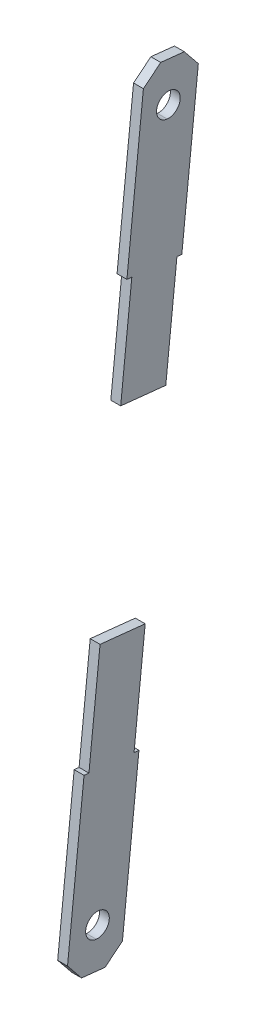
ISO-10303-21;
HEADER;
FILE_DESCRIPTION(('STEP AP214'),'2;1');
FILE_NAME('part.step','',(''),(''),'','','');
FILE_SCHEMA(('AUTOMOTIVE_DESIGN { 1 0 10303 214 1 1 1 1 }'));
ENDSEC;
DATA;
#1=APPLICATION_CONTEXT('core data for automotive mechanical design processes');
#2=APPLICATION_PROTOCOL_DEFINITION('international standard','automotive_design',2000,#1);
#3=PRODUCT_CONTEXT('',#1,'mechanical');
#4=PRODUCT('Part','Part','',(#3));
#5=PRODUCT_RELATED_PRODUCT_CATEGORY('part','',(#4));
#6=PRODUCT_DEFINITION_FORMATION('','',#4);
#7=PRODUCT_DEFINITION_CONTEXT('part definition',#1,'design');
#8=PRODUCT_DEFINITION('design','',#6,#7);
#9=PRODUCT_DEFINITION_SHAPE('','',#8);
#10=(LENGTH_UNIT() NAMED_UNIT(*) SI_UNIT(.MILLI.,.METRE.));
#11=(NAMED_UNIT(*) PLANE_ANGLE_UNIT() SI_UNIT($,.RADIAN.));
#12=(NAMED_UNIT(*) SI_UNIT($,.STERADIAN.) SOLID_ANGLE_UNIT());
#13=UNCERTAINTY_MEASURE_WITH_UNIT(LENGTH_MEASURE(1.E-05),#10,'distance_accuracy_value','');
#14=(GEOMETRIC_REPRESENTATION_CONTEXT(3) GLOBAL_UNCERTAINTY_ASSIGNED_CONTEXT((#13)) GLOBAL_UNIT_ASSIGNED_CONTEXT((#10,
#11,#12)) REPRESENTATION_CONTEXT('',''));
#15=CARTESIAN_POINT('',(0.,0.,0.));
#16=DIRECTION('',(0.,0.,1.));
#17=DIRECTION('',(1.,0.,0.));
#18=AXIS2_PLACEMENT_3D('',#15,#16,#17);
#19=CARTESIAN_POINT('',(73.25,-17.1057766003,1.7978895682));
#20=DIRECTION('',(-1.,0.,0.));
#21=DIRECTION('',(0.,-0.994521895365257,0.104528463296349));
#22=AXIS2_PLACEMENT_3D('',#19,#20,#21);
#23=CYLINDRICAL_SURFACE('',#22,0.6);
#24=DIRECTION('',(1.,0.,0.));
#25=VECTOR('',#24,1.);
#26=CARTESIAN_POINT('',(73.25,-17.7024897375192,1.86060664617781));
#27=LINE('',#26,#25);
#28=CARTESIAN_POINT('',(73.,-17.7024897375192,1.86060664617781));
#29=VERTEX_POINT('',#28);
#30=CARTESIAN_POINT('',(73.5,-17.7024897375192,1.86060664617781));
#31=VERTEX_POINT('',#30);
#32=EDGE_CURVE('P0_E11',#29,#31,#27,.T.);
#33=ORIENTED_EDGE('',*,*,#32,.F.);
#34=CARTESIAN_POINT('',(73.,-17.1057766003,1.7978895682));
#35=DIRECTION('',(1.,0.,0.));
#36=DIRECTION('',(0.,-0.994521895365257,0.104528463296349));
#37=AXIS2_PLACEMENT_3D('',#34,#35,#36);
#38=CIRCLE('',#37,0.6);
#39=CARTESIAN_POINT('',(73.,-16.5090634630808,1.73517249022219));
#40=VERTEX_POINT('',#39);
#41=EDGE_CURVE('P0_E40',#40,#29,#38,.T.);
#42=ORIENTED_EDGE('',*,*,#41,.F.);
#43=DIRECTION('',(-1.,0.,0.));
#44=VECTOR('',#43,1.);
#45=CARTESIAN_POINT('',(73.25,-16.5090634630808,1.73517249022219));
#46=LINE('',#45,#44);
#47=CARTESIAN_POINT('',(73.5,-16.5090634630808,1.73517249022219));
#48=VERTEX_POINT('',#47);
#49=EDGE_CURVE('P0_E27',#48,#40,#46,.T.);
#50=ORIENTED_EDGE('',*,*,#49,.F.);
#51=CARTESIAN_POINT('',(73.5,-17.1057766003,1.7978895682));
#52=DIRECTION('',(-1.,0.,0.));
#53=DIRECTION('',(0.,-0.994521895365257,0.104528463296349));
#54=AXIS2_PLACEMENT_3D('',#51,#52,#53);
#55=CIRCLE('',#54,0.6);
#56=EDGE_CURVE('P0_E178',#31,#48,#55,.T.);
#57=ORIENTED_EDGE('',*,*,#56,.F.);
#58=EDGE_LOOP('',(#33,#42,#50,#57));
#59=FACE_BOUND('',#58,.T.);
#60=ADVANCED_FACE('P0_F16',(#59),#23,.F.);
#61=CARTESIAN_POINT('',(73.25,-17.1057766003,1.7978895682));
#62=DIRECTION('',(-1.,0.,0.));
#63=DIRECTION('',(0.,-0.994521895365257,0.104528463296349));
#64=AXIS2_PLACEMENT_3D('',#61,#62,#63);
#65=CYLINDRICAL_SURFACE('',#64,0.6);
#66=ORIENTED_EDGE('',*,*,#32,.T.);
#67=CARTESIAN_POINT('',(73.5,-17.1057766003,1.7978895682));
#68=DIRECTION('',(-1.,0.,0.));
#69=DIRECTION('',(0.,-0.994521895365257,0.104528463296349));
#70=AXIS2_PLACEMENT_3D('',#67,#68,#69);
#71=CIRCLE('',#70,0.6);
#72=EDGE_CURVE('P0_E181',#48,#31,#71,.T.);
#73=ORIENTED_EDGE('',*,*,#72,.F.);
#74=ORIENTED_EDGE('',*,*,#49,.T.);
#75=CARTESIAN_POINT('',(73.,-17.1057766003,1.7978895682));
#76=DIRECTION('',(1.,0.,0.));
#77=DIRECTION('',(0.,-0.994521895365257,0.104528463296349));
#78=AXIS2_PLACEMENT_3D('',#75,#76,#77);
#79=CIRCLE('',#78,0.6);
#80=EDGE_CURVE('P0_E192',#29,#40,#79,.T.);
#81=ORIENTED_EDGE('',*,*,#80,.F.);
#82=EDGE_LOOP('',(#66,#73,#74,#81));
#83=FACE_BOUND('',#82,.T.);
#84=ADVANCED_FACE('P0_F308',(#83),#65,.F.);
#85=CARTESIAN_POINT('',(73.5,-7.53761086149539,1.94856934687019));
#86=DIRECTION('',(0.,0.104528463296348,0.994521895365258));
#87=DIRECTION('',(1.,0.,0.));
#88=AXIS2_PLACEMENT_3D('',#85,#86,#87);
#89=PLANE('',#88);
#90=DIRECTION('',(0.,-0.994521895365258,0.104528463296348));
#91=VECTOR('',#90,1.);
#92=CARTESIAN_POINT('',(73.,-4.8524017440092,1.66634249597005));
#93=LINE('',#92,#91);
#94=CARTESIAN_POINT('',(73.,-4.8524017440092,1.66634249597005));
#95=VERTEX_POINT('',#94);
#96=CARTESIAN_POINT('',(73.,-10.2228199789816,2.23079619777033));
#97=VERTEX_POINT('',#96);
#98=EDGE_CURVE('P0_E155',#95,#97,#93,.T.);
#99=ORIENTED_EDGE('',*,*,#98,.T.);
#100=DIRECTION('',(-1.,0.,0.));
#101=VECTOR('',#100,1.);
#102=CARTESIAN_POINT('',(73.5,-10.2228199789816,2.23079619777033));
#103=LINE('',#102,#101);
#104=CARTESIAN_POINT('',(73.5,-10.2228199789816,2.23079619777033));
#105=VERTEX_POINT('',#104);
#106=EDGE_CURVE('P0_E210',#105,#97,#103,.T.);
#107=ORIENTED_EDGE('',*,*,#106,.F.);
#108=DIRECTION('',(0.,-0.994521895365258,0.104528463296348));
#109=VECTOR('',#108,1.);
#110=CARTESIAN_POINT('',(73.5,-4.8524017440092,1.66634249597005));
#111=LINE('',#110,#109);
#112=CARTESIAN_POINT('',(73.5,-4.8524017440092,1.66634249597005));
#113=VERTEX_POINT('',#112);
#114=EDGE_CURVE('P0_E177',#113,#105,#111,.T.);
#115=ORIENTED_EDGE('',*,*,#114,.F.);
#116=DIRECTION('',(-1.,0.,0.));
#117=VECTOR('',#116,1.);
#118=CARTESIAN_POINT('',(73.5,-4.8524017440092,1.66634249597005));
#119=LINE('',#118,#117);
#120=EDGE_CURVE('P0_E159',#113,#95,#119,.T.);
#121=ORIENTED_EDGE('',*,*,#120,.T.);
#122=EDGE_LOOP('',(#99,#107,#115,#121));
#123=FACE_BOUND('',#122,.T.);
#124=ADVANCED_FACE('P0_F315',(#123),#89,.T.);
#125=CARTESIAN_POINT('',(73.5,-10.2097539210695,2.35511143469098));
#126=DIRECTION('',(0.,0.994521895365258,-0.104528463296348));
#127=DIRECTION('',(-1.,0.,0.));
#128=AXIS2_PLACEMENT_3D('',#125,#126,#127);
#129=PLANE('',#128);
#130=DIRECTION('',(0.,0.104528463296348,0.994521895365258));
#131=VECTOR('',#130,1.);
#132=CARTESIAN_POINT('',(73.,-10.2228199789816,2.23079619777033));
#133=LINE('',#132,#131);
#134=CARTESIAN_POINT('',(73.,-10.1966878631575,2.47942667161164));
#135=VERTEX_POINT('',#134);
#136=EDGE_CURVE('P0_E165',#97,#135,#133,.T.);
#137=ORIENTED_EDGE('',*,*,#136,.T.);
#138=DIRECTION('',(-1.,0.,0.));
#139=VECTOR('',#138,1.);
#140=CARTESIAN_POINT('',(73.5,-10.1966878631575,2.47942667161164));
#141=LINE('',#140,#139);
#142=CARTESIAN_POINT('',(73.5,-10.1966878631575,2.47942667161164));
#143=VERTEX_POINT('',#142);
#144=EDGE_CURVE('P0_E200',#143,#135,#141,.T.);
#145=ORIENTED_EDGE('',*,*,#144,.F.);
#146=DIRECTION('',(0.,0.104528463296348,0.994521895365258));
#147=VECTOR('',#146,1.);
#148=CARTESIAN_POINT('',(73.5,-10.2228199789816,2.23079619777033));
#149=LINE('',#148,#147);
#150=EDGE_CURVE('P0_E219',#105,#143,#149,.T.);
#151=ORIENTED_EDGE('',*,*,#150,.F.);
#152=ORIENTED_EDGE('',*,*,#106,.T.);
#153=EDGE_LOOP('',(#137,#145,#151,#152));
#154=FACE_BOUND('',#153,.T.);
#155=ADVANCED_FACE('P0_F321',(#154),#129,.T.);
#156=CARTESIAN_POINT('',(73.5,-14.1747754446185,2.89754052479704));
#157=DIRECTION('',(0.,0.104528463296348,0.994521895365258));
#158=DIRECTION('',(1.,0.,0.));
#159=AXIS2_PLACEMENT_3D('',#156,#157,#158);
#160=PLANE('',#159);
#161=DIRECTION('',(0.,-0.994521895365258,0.104528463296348));
#162=VECTOR('',#161,1.);
#163=CARTESIAN_POINT('',(73.,-10.1966878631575,2.47942667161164));
#164=LINE('',#163,#162);
#165=CARTESIAN_POINT('',(73.,-18.1528630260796,3.31565437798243));
#166=VERTEX_POINT('',#165);
#167=EDGE_CURVE('P0_E206',#135,#166,#164,.T.);
#168=ORIENTED_EDGE('',*,*,#167,.T.);
#169=DIRECTION('',(-1.,0.,0.));
#170=VECTOR('',#169,1.);
#171=CARTESIAN_POINT('',(73.5,-18.1528630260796,3.31565437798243));
#172=LINE('',#171,#170);
#173=CARTESIAN_POINT('',(73.5,-18.1528630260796,3.31565437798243));
#174=VERTEX_POINT('',#173);
#175=EDGE_CURVE('P0_E184',#174,#166,#172,.T.);
#176=ORIENTED_EDGE('',*,*,#175,.F.);
#177=DIRECTION('',(0.,-0.994521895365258,0.104528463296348));
#178=VECTOR('',#177,1.);
#179=CARTESIAN_POINT('',(73.5,-10.1966878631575,2.47942667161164));
#180=LINE('',#179,#178);
#181=EDGE_CURVE('P0_E173',#143,#174,#180,.T.);
#182=ORIENTED_EDGE('',*,*,#181,.F.);
#183=ORIENTED_EDGE('',*,*,#144,.T.);
#184=EDGE_LOOP('',(#168,#176,#182,#183));
#185=FACE_BOUND('',#184,.T.);
#186=ADVANCED_FACE('P0_F286',(#185),#160,.T.);
#187=CARTESIAN_POINT('',(73.5,-18.5924831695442,2.95965700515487));
#188=DIRECTION('',(0.,-0.629320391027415,0.777145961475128));
#189=DIRECTION('',(-1.,0.,0.));
#190=AXIS2_PLACEMENT_3D('',#187,#188,#189);
#191=PLANE('',#190);
#192=DIRECTION('',(0.,-0.777145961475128,-0.629320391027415));
#193=VECTOR('',#192,1.);
#194=CARTESIAN_POINT('',(73.,-18.1528630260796,3.31565437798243));
#195=LINE('',#194,#193);
#196=CARTESIAN_POINT('',(73.,-19.0321033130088,2.6036596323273));
#197=VERTEX_POINT('',#196);
#198=EDGE_CURVE('P0_E187',#166,#197,#195,.T.);
#199=ORIENTED_EDGE('',*,*,#198,.T.);
#200=DIRECTION('',(-1.,0.,0.));
#201=VECTOR('',#200,1.);
#202=CARTESIAN_POINT('',(73.5,-19.0321033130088,2.6036596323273));
#203=LINE('',#202,#201);
#204=CARTESIAN_POINT('',(73.5,-19.0321033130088,2.6036596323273));
#205=VERTEX_POINT('',#204);
#206=EDGE_CURVE('P0_E168',#205,#197,#203,.T.);
#207=ORIENTED_EDGE('',*,*,#206,.F.);
#208=DIRECTION('',(0.,-0.777145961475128,-0.629320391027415));
#209=VECTOR('',#208,1.);
#210=CARTESIAN_POINT('',(73.5,-18.1528630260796,3.31565437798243));
#211=LINE('',#210,#209);
#212=EDGE_CURVE('P0_E170',#174,#205,#211,.T.);
#213=ORIENTED_EDGE('',*,*,#212,.F.);
#214=ORIENTED_EDGE('',*,*,#175,.T.);
#215=EDGE_LOOP('',(#199,#207,#213,#214));
#216=FACE_BOUND('',#215,.T.);
#217=ADVANCED_FACE('P0_F18',(#216),#191,.T.);
#218=CARTESIAN_POINT('',(73.5,-19.0948203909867,2.00694649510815));
#219=DIRECTION('',(0.,-0.994521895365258,0.104528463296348));
#220=DIRECTION('',(-1.,0.,0.));
#221=AXIS2_PLACEMENT_3D('',#218,#219,#220);
#222=PLANE('',#221);
#223=DIRECTION('',(0.,-0.104528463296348,-0.994521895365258));
#224=VECTOR('',#223,1.);
#225=CARTESIAN_POINT('',(73.,-19.0321033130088,2.6036596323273));
#226=LINE('',#225,#224);
#227=CARTESIAN_POINT('',(73.,-19.1575374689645,1.41023335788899));
#228=VERTEX_POINT('',#227);
#229=EDGE_CURVE('P0_E20',#197,#228,#226,.T.);
#230=ORIENTED_EDGE('',*,*,#229,.T.);
#231=DIRECTION('',(-1.,0.,0.));
#232=VECTOR('',#231,1.);
#233=CARTESIAN_POINT('',(73.5,-19.1575374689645,1.41023335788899));
#234=LINE('',#233,#232);
#235=CARTESIAN_POINT('',(73.5,-19.1575374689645,1.41023335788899));
#236=VERTEX_POINT('',#235);
#237=EDGE_CURVE('P0_E169',#236,#228,#234,.T.);
#238=ORIENTED_EDGE('',*,*,#237,.F.);
#239=DIRECTION('',(0.,-0.104528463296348,-0.994521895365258));
#240=VECTOR('',#239,1.);
#241=CARTESIAN_POINT('',(73.5,-19.0321033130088,2.6036596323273));
#242=LINE('',#241,#240);
#243=EDGE_CURVE('P0_E125',#205,#236,#242,.T.);
#244=ORIENTED_EDGE('',*,*,#243,.F.);
#245=ORIENTED_EDGE('',*,*,#206,.T.);
#246=EDGE_LOOP('',(#230,#238,#244,#245));
#247=FACE_BOUND('',#246,.T.);
#248=ADVANCED_FACE('P0_F293',(#247),#222,.T.);
#249=CARTESIAN_POINT('',(73.5,-18.8015400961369,0.97061321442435));
#250=DIRECTION('',(0.,-0.777145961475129,-0.629320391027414));
#251=DIRECTION('',(0.,0.629320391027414,-0.777145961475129));
#252=AXIS2_PLACEMENT_3D('',#249,#250,#251);
#253=PLANE('',#252);
#254=DIRECTION('',(0.,0.629320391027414,-0.777145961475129));
#255=VECTOR('',#254,1.);
#256=CARTESIAN_POINT('',(73.,-19.1575374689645,1.41023335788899));
#257=LINE('',#256,#255);
#258=CARTESIAN_POINT('',(73.,-18.4455427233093,0.530993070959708));
#259=VERTEX_POINT('',#258);
#260=EDGE_CURVE('P0_E134',#228,#259,#257,.T.);
#261=ORIENTED_EDGE('',*,*,#260,.T.);
#262=DIRECTION('',(-1.,0.,0.));
#263=VECTOR('',#262,1.);
#264=CARTESIAN_POINT('',(73.5,-18.4455427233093,0.530993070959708));
#265=LINE('',#264,#263);
#266=CARTESIAN_POINT('',(73.5,-18.4455427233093,0.530993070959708));
#267=VERTEX_POINT('',#266);
#268=EDGE_CURVE('P0_E131',#267,#259,#265,.T.);
#269=ORIENTED_EDGE('',*,*,#268,.F.);
#270=DIRECTION('',(0.,0.629320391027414,-0.777145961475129));
#271=VECTOR('',#270,1.);
#272=CARTESIAN_POINT('',(73.5,-19.1575374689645,1.41023335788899));
#273=LINE('',#272,#271);
#274=EDGE_CURVE('P0_E116',#236,#267,#273,.T.);
#275=ORIENTED_EDGE('',*,*,#274,.F.);
#276=ORIENTED_EDGE('',*,*,#237,.T.);
#277=EDGE_LOOP('',(#261,#269,#275,#276));
#278=FACE_BOUND('',#277,.T.);
#279=ADVANCED_FACE('P0_F132',(#278),#253,.T.);
#280=CARTESIAN_POINT('',(73.5,-14.4674551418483,0.112879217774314));
#281=DIRECTION('',(0.,-0.104528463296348,-0.994521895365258));
#282=DIRECTION('',(0.,-0.994521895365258,0.104528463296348));
#283=AXIS2_PLACEMENT_3D('',#280,#281,#282);
#284=PLANE('',#283);
#285=DIRECTION('',(0.,0.994521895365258,-0.104528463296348));
#286=VECTOR('',#285,1.);
#287=CARTESIAN_POINT('',(73.,-18.4455427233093,0.530993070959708));
#288=LINE('',#287,#286);
#289=CARTESIAN_POINT('',(73.,-10.4893675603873,-0.305234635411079));
#290=VERTEX_POINT('',#289);
#291=EDGE_CURVE('P0_E139',#259,#290,#288,.T.);
#292=ORIENTED_EDGE('',*,*,#291,.T.);
#293=DIRECTION('',(-1.,0.,0.));
#294=VECTOR('',#293,1.);
#295=CARTESIAN_POINT('',(73.5,-10.4893675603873,-0.305234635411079));
#296=LINE('',#295,#294);
#297=CARTESIAN_POINT('',(73.5,-10.4893675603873,-0.305234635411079));
#298=VERTEX_POINT('',#297);
#299=EDGE_CURVE('P0_E143',#298,#290,#296,.T.);
#300=ORIENTED_EDGE('',*,*,#299,.F.);
#301=DIRECTION('',(0.,0.994521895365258,-0.104528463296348));
#302=VECTOR('',#301,1.);
#303=CARTESIAN_POINT('',(73.5,-18.4455427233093,0.530993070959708));
#304=LINE('',#303,#302);
#305=EDGE_CURVE('P0_E122',#267,#298,#304,.T.);
#306=ORIENTED_EDGE('',*,*,#305,.F.);
#307=ORIENTED_EDGE('',*,*,#268,.T.);
#308=EDGE_LOOP('',(#292,#300,#306,#307));
#309=FACE_BOUND('',#308,.T.);
#310=ADVANCED_FACE('P0_F142',(#309),#284,.T.);
#311=CARTESIAN_POINT('',(73.5,-10.4763015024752,-0.180919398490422));
#312=DIRECTION('',(0.,0.994521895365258,-0.104528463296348));
#313=DIRECTION('',(-1.,0.,0.));
#314=AXIS2_PLACEMENT_3D('',#311,#312,#313);
#315=PLANE('',#314);
#316=DIRECTION('',(0.,0.104528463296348,0.994521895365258));
#317=VECTOR('',#316,1.);
#318=CARTESIAN_POINT('',(73.,-10.4893675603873,-0.305234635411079));
#319=LINE('',#318,#317);
#320=CARTESIAN_POINT('',(73.,-10.4632354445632,-0.0566041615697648));
#321=VERTEX_POINT('',#320);
#322=EDGE_CURVE('P0_E140',#290,#321,#319,.T.);
#323=ORIENTED_EDGE('',*,*,#322,.T.);
#324=DIRECTION('',(-1.,0.,0.));
#325=VECTOR('',#324,1.);
#326=CARTESIAN_POINT('',(73.5,-10.4632354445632,-0.0566041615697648));
#327=LINE('',#326,#325);
#328=CARTESIAN_POINT('',(73.5,-10.4632354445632,-0.0566041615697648));
#329=VERTEX_POINT('',#328);
#330=EDGE_CURVE('P0_E196',#329,#321,#327,.T.);
#331=ORIENTED_EDGE('',*,*,#330,.F.);
#332=DIRECTION('',(0.,0.104528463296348,0.994521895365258));
#333=VECTOR('',#332,1.);
#334=CARTESIAN_POINT('',(73.5,-10.4893675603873,-0.305234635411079));
#335=LINE('',#334,#333);
#336=EDGE_CURVE('P0_E146',#298,#329,#335,.T.);
#337=ORIENTED_EDGE('',*,*,#336,.F.);
#338=ORIENTED_EDGE('',*,*,#299,.T.);
#339=EDGE_LOOP('',(#323,#331,#337,#338));
#340=FACE_BOUND('',#339,.T.);
#341=ADVANCED_FACE('P0_F296',(#340),#315,.T.);
#342=CARTESIAN_POINT('',(73.5,-7.778026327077,-0.338831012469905));
#343=DIRECTION('',(0.,-0.104528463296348,-0.994521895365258));
#344=DIRECTION('',(0.,-0.994521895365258,0.104528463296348));
#345=AXIS2_PLACEMENT_3D('',#342,#343,#344);
#346=PLANE('',#345);
#347=DIRECTION('',(0.,0.994521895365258,-0.104528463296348));
#348=VECTOR('',#347,1.);
#349=CARTESIAN_POINT('',(73.,-10.4632354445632,-0.0566041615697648));
#350=LINE('',#349,#348);
#351=CARTESIAN_POINT('',(73.,-5.0928172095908,-0.621057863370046));
#352=VERTEX_POINT('',#351);
#353=EDGE_CURVE('P0_E162',#321,#352,#350,.T.);
#354=ORIENTED_EDGE('',*,*,#353,.T.);
#355=DIRECTION('',(-1.,0.,0.));
#356=VECTOR('',#355,1.);
#357=CARTESIAN_POINT('',(73.5,-5.0928172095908,-0.621057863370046));
#358=LINE('',#357,#356);
#359=CARTESIAN_POINT('',(73.5,-5.0928172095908,-0.621057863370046));
#360=VERTEX_POINT('',#359);
#361=EDGE_CURVE('P0_E188',#360,#352,#358,.T.);
#362=ORIENTED_EDGE('',*,*,#361,.F.);
#363=DIRECTION('',(0.,0.994521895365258,-0.104528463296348));
#364=VECTOR('',#363,1.);
#365=CARTESIAN_POINT('',(73.5,-10.4632354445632,-0.0566041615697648));
#366=LINE('',#365,#364);
#367=EDGE_CURVE('P0_E152',#329,#360,#366,.T.);
#368=ORIENTED_EDGE('',*,*,#367,.F.);
#369=ORIENTED_EDGE('',*,*,#330,.T.);
#370=EDGE_LOOP('',(#354,#362,#368,#369));
#371=FACE_BOUND('',#370,.T.);
#372=ADVANCED_FACE('P0_F254',(#371),#346,.T.);
#373=CARTESIAN_POINT('',(73.5,-4.9125056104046,1.09449240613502));
#374=DIRECTION('',(0.,0.994521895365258,-0.104528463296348));
#375=DIRECTION('',(-1.,0.,0.));
#376=AXIS2_PLACEMENT_3D('',#373,#374,#375);
#377=PLANE('',#376);
#378=DIRECTION('',(0.,0.104528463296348,0.994521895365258));
#379=VECTOR('',#378,1.);
#380=CARTESIAN_POINT('',(73.,-5.0928172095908,-0.621057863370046));
#381=LINE('',#380,#379);
#382=EDGE_CURVE('P0_E191',#352,#95,#381,.T.);
#383=ORIENTED_EDGE('',*,*,#382,.T.);
#384=ORIENTED_EDGE('',*,*,#120,.F.);
#385=DIRECTION('',(0.,0.104528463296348,0.994521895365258));
#386=VECTOR('',#385,1.);
#387=CARTESIAN_POINT('',(73.5,-4.9726094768,0.5226423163));
#388=LINE('',#387,#386);
#389=EDGE_CURVE('P0_E174',#360,#113,#388,.T.);
#390=ORIENTED_EDGE('',*,*,#389,.F.);
#391=ORIENTED_EDGE('',*,*,#361,.T.);
#392=EDGE_LOOP('',(#383,#384,#390,#391));
#393=FACE_BOUND('',#392,.T.);
#394=ADVANCED_FACE('P0_F265',(#393),#377,.T.);
#395=CARTESIAN_POINT('',(73.,-11.9067891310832,1.25145396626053));
#396=DIRECTION('',(-1.,0.,0.));
#397=DIRECTION('',(0.,0.,1.));
#398=AXIS2_PLACEMENT_3D('',#395,#396,#397);
#399=PLANE('',#398);
#400=ORIENTED_EDGE('',*,*,#98,.F.);
#401=ORIENTED_EDGE('',*,*,#382,.F.);
#402=ORIENTED_EDGE('',*,*,#353,.F.);
#403=ORIENTED_EDGE('',*,*,#322,.F.);
#404=ORIENTED_EDGE('',*,*,#291,.F.);
#405=ORIENTED_EDGE('',*,*,#260,.F.);
#406=ORIENTED_EDGE('',*,*,#229,.F.);
#407=ORIENTED_EDGE('',*,*,#198,.F.);
#408=ORIENTED_EDGE('',*,*,#167,.F.);
#409=ORIENTED_EDGE('',*,*,#136,.F.);
#410=EDGE_LOOP('',(#400,#401,#402,#403,#404,#405,#406,#407,#408,#409));
#411=FACE_BOUND('',#410,.T.);
#412=ORIENTED_EDGE('',*,*,#80,.T.);
#413=ORIENTED_EDGE('',*,*,#41,.T.);
#414=EDGE_LOOP('',(#412,#413));
#415=FACE_BOUND('',#414,.T.);
#416=ADVANCED_FACE('P0_F261',(#411,#415),#399,.T.);
#417=CARTESIAN_POINT('',(73.5,-11.9067891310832,1.25145396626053));
#418=DIRECTION('',(-1.,0.,0.));
#419=DIRECTION('',(0.,0.,1.));
#420=AXIS2_PLACEMENT_3D('',#417,#418,#419);
#421=PLANE('',#420);
#422=ORIENTED_EDGE('',*,*,#389,.T.);
#423=ORIENTED_EDGE('',*,*,#114,.T.);
#424=ORIENTED_EDGE('',*,*,#150,.T.);
#425=ORIENTED_EDGE('',*,*,#181,.T.);
#426=ORIENTED_EDGE('',*,*,#212,.T.);
#427=ORIENTED_EDGE('',*,*,#243,.T.);
#428=ORIENTED_EDGE('',*,*,#274,.T.);
#429=ORIENTED_EDGE('',*,*,#305,.T.);
#430=ORIENTED_EDGE('',*,*,#336,.T.);
#431=ORIENTED_EDGE('',*,*,#367,.T.);
#432=EDGE_LOOP('',(#422,#423,#424,#425,#426,#427,#428,#429,#430,#431));
#433=FACE_BOUND('',#432,.T.);
#434=ORIENTED_EDGE('',*,*,#56,.T.);
#435=ORIENTED_EDGE('',*,*,#72,.T.);
#436=EDGE_LOOP('',(#434,#435));
#437=FACE_BOUND('',#436,.T.);
#438=ADVANCED_FACE('P0_F119',(#433,#437),#421,.F.);
#439=CLOSED_SHELL('',(#60,#84,#124,#155,#186,#217,#248,#279,#310,#341,#372,#394,#416,#438));
#440=MANIFOLD_SOLID_BREP('P0_B1',#439);
#441=CARTESIAN_POINT('',(73.25,17.1057766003,-1.7978895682));
#442=DIRECTION('',(-1.,0.,0.));
#443=DIRECTION('',(0.,0.994521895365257,-0.104528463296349));
#444=AXIS2_PLACEMENT_3D('',#441,#442,#443);
#445=CYLINDRICAL_SURFACE('',#444,0.6);
#446=DIRECTION('',(1.,0.,0.));
#447=VECTOR('',#446,1.);
#448=CARTESIAN_POINT('',(73.25,17.7024897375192,-1.86060664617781));
#449=LINE('',#448,#447);
#450=CARTESIAN_POINT('',(73.,17.7024897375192,-1.86060664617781));
#451=VERTEX_POINT('',#450);
#452=CARTESIAN_POINT('',(73.5,17.7024897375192,-1.86060664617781));
#453=VERTEX_POINT('',#452);
#454=EDGE_CURVE('P1_E11',#451,#453,#449,.T.);
#455=ORIENTED_EDGE('',*,*,#454,.F.);
#456=CARTESIAN_POINT('',(73.,17.1057766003,-1.7978895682));
#457=DIRECTION('',(1.,0.,0.));
#458=DIRECTION('',(0.,0.994521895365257,-0.104528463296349));
#459=AXIS2_PLACEMENT_3D('',#456,#457,#458);
#460=CIRCLE('',#459,0.6);
#461=CARTESIAN_POINT('',(73.,16.5090634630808,-1.73517249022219));
#462=VERTEX_POINT('',#461);
#463=EDGE_CURVE('P1_E40',#462,#451,#460,.T.);
#464=ORIENTED_EDGE('',*,*,#463,.F.);
#465=DIRECTION('',(-1.,0.,0.));
#466=VECTOR('',#465,1.);
#467=CARTESIAN_POINT('',(73.25,16.5090634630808,-1.73517249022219));
#468=LINE('',#467,#466);
#469=CARTESIAN_POINT('',(73.5,16.5090634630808,-1.73517249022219));
#470=VERTEX_POINT('',#469);
#471=EDGE_CURVE('P1_E27',#470,#462,#468,.T.);
#472=ORIENTED_EDGE('',*,*,#471,.F.);
#473=CARTESIAN_POINT('',(73.5,17.1057766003,-1.7978895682));
#474=DIRECTION('',(-1.,0.,0.));
#475=DIRECTION('',(0.,0.994521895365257,-0.104528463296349));
#476=AXIS2_PLACEMENT_3D('',#473,#474,#475);
#477=CIRCLE('',#476,0.6);
#478=EDGE_CURVE('P1_E145',#453,#470,#477,.T.);
#479=ORIENTED_EDGE('',*,*,#478,.F.);
#480=EDGE_LOOP('',(#455,#464,#472,#479));
#481=FACE_BOUND('',#480,.T.);
#482=ADVANCED_FACE('P1_F16',(#481),#445,.F.);
#483=CARTESIAN_POINT('',(73.25,17.1057766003,-1.7978895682));
#484=DIRECTION('',(-1.,0.,0.));
#485=DIRECTION('',(0.,0.994521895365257,-0.104528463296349));
#486=AXIS2_PLACEMENT_3D('',#483,#484,#485);
#487=CYLINDRICAL_SURFACE('',#486,0.6);
#488=ORIENTED_EDGE('',*,*,#454,.T.);
#489=CARTESIAN_POINT('',(73.5,17.1057766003,-1.7978895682));
#490=DIRECTION('',(-1.,0.,0.));
#491=DIRECTION('',(0.,0.994521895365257,-0.104528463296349));
#492=AXIS2_PLACEMENT_3D('',#489,#490,#491);
#493=CIRCLE('',#492,0.6);
#494=EDGE_CURVE('P1_E149',#470,#453,#493,.T.);
#495=ORIENTED_EDGE('',*,*,#494,.F.);
#496=ORIENTED_EDGE('',*,*,#471,.T.);
#497=CARTESIAN_POINT('',(73.,17.1057766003,-1.7978895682));
#498=DIRECTION('',(1.,0.,0.));
#499=DIRECTION('',(0.,0.994521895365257,-0.104528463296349));
#500=AXIS2_PLACEMENT_3D('',#497,#498,#499);
#501=CIRCLE('',#500,0.6);
#502=EDGE_CURVE('P1_E214',#451,#462,#501,.T.);
#503=ORIENTED_EDGE('',*,*,#502,.F.);
#504=EDGE_LOOP('',(#488,#495,#496,#503));
#505=FACE_BOUND('',#504,.T.);
#506=ADVANCED_FACE('P1_F159',(#505),#487,.F.);
#507=CARTESIAN_POINT('',(73.5,7.53761086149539,-1.94856934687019));
#508=DIRECTION('',(0.,-0.104528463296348,-0.994521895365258));
#509=DIRECTION('',(0.,-0.994521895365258,0.104528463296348));
#510=AXIS2_PLACEMENT_3D('',#507,#508,#509);
#511=PLANE('',#510);
#512=DIRECTION('',(0.,0.994521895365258,-0.104528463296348));
#513=VECTOR('',#512,1.);
#514=CARTESIAN_POINT('',(73.,4.8524017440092,-1.66634249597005));
#515=LINE('',#514,#513);
#516=CARTESIAN_POINT('',(73.,4.8524017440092,-1.66634249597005));
#517=VERTEX_POINT('',#516);
#518=CARTESIAN_POINT('',(73.,10.2228199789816,-2.23079619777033));
#519=VERTEX_POINT('',#518);
#520=EDGE_CURVE('P1_E157',#517,#519,#515,.T.);
#521=ORIENTED_EDGE('',*,*,#520,.T.);
#522=DIRECTION('',(-1.,0.,0.));
#523=VECTOR('',#522,1.);
#524=CARTESIAN_POINT('',(73.5,10.2228199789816,-2.23079619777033));
#525=LINE('',#524,#523);
#526=CARTESIAN_POINT('',(73.5,10.2228199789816,-2.23079619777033));
#527=VERTEX_POINT('',#526);
#528=EDGE_CURVE('P1_E208',#527,#519,#525,.T.);
#529=ORIENTED_EDGE('',*,*,#528,.F.);
#530=DIRECTION('',(0.,0.994521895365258,-0.104528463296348));
#531=VECTOR('',#530,1.);
#532=CARTESIAN_POINT('',(73.5,4.8524017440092,-1.66634249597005));
#533=LINE('',#532,#531);
#534=CARTESIAN_POINT('',(73.5,4.8524017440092,-1.66634249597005));
#535=VERTEX_POINT('',#534);
#536=EDGE_CURVE('P1_E219',#535,#527,#533,.T.);
#537=ORIENTED_EDGE('',*,*,#536,.F.);
#538=DIRECTION('',(-1.,0.,0.));
#539=VECTOR('',#538,1.);
#540=CARTESIAN_POINT('',(73.5,4.8524017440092,-1.66634249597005));
#541=LINE('',#540,#539);
#542=EDGE_CURVE('P1_E207',#535,#517,#541,.T.);
#543=ORIENTED_EDGE('',*,*,#542,.T.);
#544=EDGE_LOOP('',(#521,#529,#537,#543));
#545=FACE_BOUND('',#544,.T.);
#546=ADVANCED_FACE('P1_F371',(#545),#511,.T.);
#547=CARTESIAN_POINT('',(73.5,10.2097539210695,-2.35511143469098));
#548=DIRECTION('',(0.,-0.994521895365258,0.104528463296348));
#549=DIRECTION('',(-1.,0.,0.));
#550=AXIS2_PLACEMENT_3D('',#547,#548,#549);
#551=PLANE('',#550);
#552=DIRECTION('',(0.,-0.104528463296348,-0.994521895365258));
#553=VECTOR('',#552,1.);
#554=CARTESIAN_POINT('',(73.,10.2228199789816,-2.23079619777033));
#555=LINE('',#554,#553);
#556=CARTESIAN_POINT('',(73.,10.1966878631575,-2.47942667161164));
#557=VERTEX_POINT('',#556);
#558=EDGE_CURVE('P1_E203',#519,#557,#555,.T.);
#559=ORIENTED_EDGE('',*,*,#558,.T.);
#560=DIRECTION('',(-1.,0.,0.));
#561=VECTOR('',#560,1.);
#562=CARTESIAN_POINT('',(73.5,10.1966878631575,-2.47942667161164));
#563=LINE('',#562,#561);
#564=CARTESIAN_POINT('',(73.5,10.1966878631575,-2.47942667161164));
#565=VERTEX_POINT('',#564);
#566=EDGE_CURVE('P1_E222',#565,#557,#563,.T.);
#567=ORIENTED_EDGE('',*,*,#566,.F.);
#568=DIRECTION('',(0.,-0.104528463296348,-0.994521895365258));
#569=VECTOR('',#568,1.);
#570=CARTESIAN_POINT('',(73.5,10.2228199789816,-2.23079619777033));
#571=LINE('',#570,#569);
#572=EDGE_CURVE('P1_E20',#527,#565,#571,.T.);
#573=ORIENTED_EDGE('',*,*,#572,.F.);
#574=ORIENTED_EDGE('',*,*,#528,.T.);
#575=EDGE_LOOP('',(#559,#567,#573,#574));
#576=FACE_BOUND('',#575,.T.);
#577=ADVANCED_FACE('P1_F375',(#576),#551,.T.);
#578=CARTESIAN_POINT('',(73.5,14.1747754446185,-2.89754052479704));
#579=DIRECTION('',(0.,-0.104528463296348,-0.994521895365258));
#580=DIRECTION('',(0.,-0.994521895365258,0.104528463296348));
#581=AXIS2_PLACEMENT_3D('',#578,#579,#580);
#582=PLANE('',#581);
#583=DIRECTION('',(0.,0.994521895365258,-0.104528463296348));
#584=VECTOR('',#583,1.);
#585=CARTESIAN_POINT('',(73.,10.1966878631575,-2.47942667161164));
#586=LINE('',#585,#584);
#587=CARTESIAN_POINT('',(73.,18.1528630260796,-3.31565437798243));
#588=VERTEX_POINT('',#587);
#589=EDGE_CURVE('P1_E226',#557,#588,#586,.T.);
#590=ORIENTED_EDGE('',*,*,#589,.T.);
#591=DIRECTION('',(-1.,0.,0.));
#592=VECTOR('',#591,1.);
#593=CARTESIAN_POINT('',(73.5,18.1528630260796,-3.31565437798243));
#594=LINE('',#593,#592);
#595=CARTESIAN_POINT('',(73.5,18.1528630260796,-3.31565437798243));
#596=VERTEX_POINT('',#595);
#597=EDGE_CURVE('P1_E93',#596,#588,#594,.T.);
#598=ORIENTED_EDGE('',*,*,#597,.F.);
#599=DIRECTION('',(0.,0.994521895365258,-0.104528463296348));
#600=VECTOR('',#599,1.);
#601=CARTESIAN_POINT('',(73.5,10.1966878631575,-2.47942667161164));
#602=LINE('',#601,#600);
#603=EDGE_CURVE('P1_E173',#565,#596,#602,.T.);
#604=ORIENTED_EDGE('',*,*,#603,.F.);
#605=ORIENTED_EDGE('',*,*,#566,.T.);
#606=EDGE_LOOP('',(#590,#598,#604,#605));
#607=FACE_BOUND('',#606,.T.);
#608=ADVANCED_FACE('P1_F389',(#607),#582,.T.);
#609=CARTESIAN_POINT('',(73.5,18.5924831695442,-2.95965700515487));
#610=DIRECTION('',(0.,0.629320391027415,-0.777145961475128));
#611=DIRECTION('',(-1.,0.,0.));
#612=AXIS2_PLACEMENT_3D('',#609,#610,#611);
#613=PLANE('',#612);
#614=DIRECTION('',(0.,0.777145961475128,0.629320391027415));
#615=VECTOR('',#614,1.);
#616=CARTESIAN_POINT('',(73.,18.1528630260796,-3.31565437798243));
#617=LINE('',#616,#615);
#618=CARTESIAN_POINT('',(73.,19.0321033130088,-2.6036596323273));
#619=VERTEX_POINT('',#618);
#620=EDGE_CURVE('P1_E220',#588,#619,#617,.T.);
#621=ORIENTED_EDGE('',*,*,#620,.T.);
#622=DIRECTION('',(-1.,0.,0.));
#623=VECTOR('',#622,1.);
#624=CARTESIAN_POINT('',(73.5,19.0321033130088,-2.6036596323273));
#625=LINE('',#624,#623);
#626=CARTESIAN_POINT('',(73.5,19.0321033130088,-2.6036596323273));
#627=VERTEX_POINT('',#626);
#628=EDGE_CURVE('P1_E195',#627,#619,#625,.T.);
#629=ORIENTED_EDGE('',*,*,#628,.F.);
#630=DIRECTION('',(0.,0.777145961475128,0.629320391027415));
#631=VECTOR('',#630,1.);
#632=CARTESIAN_POINT('',(73.5,18.1528630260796,-3.31565437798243));
#633=LINE('',#632,#631);
#634=EDGE_CURVE('P1_E169',#596,#627,#633,.T.);
#635=ORIENTED_EDGE('',*,*,#634,.F.);
#636=ORIENTED_EDGE('',*,*,#597,.T.);
#637=EDGE_LOOP('',(#621,#629,#635,#636));
#638=FACE_BOUND('',#637,.T.);
#639=ADVANCED_FACE('P1_F393',(#638),#613,.T.);
#640=CARTESIAN_POINT('',(73.5,19.0948203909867,-2.00694649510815));
#641=DIRECTION('',(0.,0.994521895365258,-0.104528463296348));
#642=DIRECTION('',(-1.,0.,0.));
#643=AXIS2_PLACEMENT_3D('',#640,#641,#642);
#644=PLANE('',#643);
#645=DIRECTION('',(0.,0.104528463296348,0.994521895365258));
#646=VECTOR('',#645,1.);
#647=CARTESIAN_POINT('',(73.,19.0321033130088,-2.6036596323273));
#648=LINE('',#647,#646);
#649=CARTESIAN_POINT('',(73.,19.1575374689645,-1.41023335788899));
#650=VERTEX_POINT('',#649);
#651=EDGE_CURVE('P1_E199',#619,#650,#648,.T.);
#652=ORIENTED_EDGE('',*,*,#651,.T.);
#653=DIRECTION('',(-1.,0.,0.));
#654=VECTOR('',#653,1.);
#655=CARTESIAN_POINT('',(73.5,19.1575374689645,-1.41023335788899));
#656=LINE('',#655,#654);
#657=CARTESIAN_POINT('',(73.5,19.1575374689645,-1.41023335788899));
#658=VERTEX_POINT('',#657);
#659=EDGE_CURVE('P1_E233',#658,#650,#656,.T.);
#660=ORIENTED_EDGE('',*,*,#659,.F.);
#661=DIRECTION('',(0.,0.104528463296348,0.994521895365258));
#662=VECTOR('',#661,1.);
#663=CARTESIAN_POINT('',(73.5,19.0321033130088,-2.6036596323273));
#664=LINE('',#663,#662);
#665=EDGE_CURVE('P1_E174',#627,#658,#664,.T.);
#666=ORIENTED_EDGE('',*,*,#665,.F.);
#667=ORIENTED_EDGE('',*,*,#628,.T.);
#668=EDGE_LOOP('',(#652,#660,#666,#667));
#669=FACE_BOUND('',#668,.T.);
#670=ADVANCED_FACE('P1_F409',(#669),#644,.T.);
#671=CARTESIAN_POINT('',(73.5,18.8015400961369,-0.97061321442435));
#672=DIRECTION('',(0.,0.777145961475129,0.629320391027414));
#673=DIRECTION('',(1.,0.,0.));
#674=AXIS2_PLACEMENT_3D('',#671,#672,#673);
#675=PLANE('',#674);
#676=DIRECTION('',(0.,-0.629320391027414,0.777145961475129));
#677=VECTOR('',#676,1.);
#678=CARTESIAN_POINT('',(73.,19.1575374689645,-1.41023335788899));
#679=LINE('',#678,#677);
#680=CARTESIAN_POINT('',(73.,18.4455427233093,-0.530993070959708));
#681=VERTEX_POINT('',#680);
#682=EDGE_CURVE('P1_E200',#650,#681,#679,.T.);
#683=ORIENTED_EDGE('',*,*,#682,.T.);
#684=DIRECTION('',(-1.,0.,0.));
#685=VECTOR('',#684,1.);
#686=CARTESIAN_POINT('',(73.5,18.4455427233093,-0.530993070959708));
#687=LINE('',#686,#685);
#688=CARTESIAN_POINT('',(73.5,18.4455427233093,-0.530993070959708));
#689=VERTEX_POINT('',#688);
#690=EDGE_CURVE('P1_E167',#689,#681,#687,.T.);
#691=ORIENTED_EDGE('',*,*,#690,.F.);
#692=DIRECTION('',(0.,-0.629320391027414,0.777145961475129));
#693=VECTOR('',#692,1.);
#694=CARTESIAN_POINT('',(73.5,19.1575374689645,-1.41023335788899));
#695=LINE('',#694,#693);
#696=EDGE_CURVE('P1_E177',#658,#689,#695,.T.);
#697=ORIENTED_EDGE('',*,*,#696,.F.);
#698=ORIENTED_EDGE('',*,*,#659,.T.);
#699=EDGE_LOOP('',(#683,#691,#697,#698));
#700=FACE_BOUND('',#699,.T.);
#701=ADVANCED_FACE('P1_F426',(#700),#675,.T.);
#702=CARTESIAN_POINT('',(73.5,14.4674551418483,-0.112879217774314));
#703=DIRECTION('',(0.,0.104528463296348,0.994521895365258));
#704=DIRECTION('',(1.,0.,0.));
#705=AXIS2_PLACEMENT_3D('',#702,#703,#704);
#706=PLANE('',#705);
#707=DIRECTION('',(0.,-0.994521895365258,0.104528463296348));
#708=VECTOR('',#707,1.);
#709=CARTESIAN_POINT('',(73.,18.4455427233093,-0.530993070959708));
#710=LINE('',#709,#708);
#711=CARTESIAN_POINT('',(73.,10.4893675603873,0.305234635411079));
#712=VERTEX_POINT('',#711);
#713=EDGE_CURVE('P1_E250',#681,#712,#710,.T.);
#714=ORIENTED_EDGE('',*,*,#713,.T.);
#715=DIRECTION('',(-1.,0.,0.));
#716=VECTOR('',#715,1.);
#717=CARTESIAN_POINT('',(73.5,10.4893675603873,0.305234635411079));
#718=LINE('',#717,#716);
#719=CARTESIAN_POINT('',(73.5,10.4893675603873,0.305234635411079));
#720=VERTEX_POINT('',#719);
#721=EDGE_CURVE('P1_E193',#720,#712,#718,.T.);
#722=ORIENTED_EDGE('',*,*,#721,.F.);
#723=DIRECTION('',(0.,-0.994521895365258,0.104528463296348));
#724=VECTOR('',#723,1.);
#725=CARTESIAN_POINT('',(73.5,18.4455427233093,-0.530993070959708));
#726=LINE('',#725,#724);
#727=EDGE_CURVE('P1_E183',#689,#720,#726,.T.);
#728=ORIENTED_EDGE('',*,*,#727,.F.);
#729=ORIENTED_EDGE('',*,*,#690,.T.);
#730=EDGE_LOOP('',(#714,#722,#728,#729));
#731=FACE_BOUND('',#730,.T.);
#732=ADVANCED_FACE('P1_F417',(#731),#706,.T.);
#733=CARTESIAN_POINT('',(73.5,10.4763015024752,0.180919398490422));
#734=DIRECTION('',(0.,-0.994521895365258,0.104528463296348));
#735=DIRECTION('',(-1.,0.,0.));
#736=AXIS2_PLACEMENT_3D('',#733,#734,#735);
#737=PLANE('',#736);
#738=DIRECTION('',(0.,-0.104528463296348,-0.994521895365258));
#739=VECTOR('',#738,1.);
#740=CARTESIAN_POINT('',(73.,10.4893675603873,0.305234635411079));
#741=LINE('',#740,#739);
#742=CARTESIAN_POINT('',(73.,10.4632354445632,0.0566041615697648));
#743=VERTEX_POINT('',#742);
#744=EDGE_CURVE('P1_E245',#712,#743,#741,.T.);
#745=ORIENTED_EDGE('',*,*,#744,.T.);
#746=DIRECTION('',(-1.,0.,0.));
#747=VECTOR('',#746,1.);
#748=CARTESIAN_POINT('',(73.5,10.4632354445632,0.0566041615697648));
#749=LINE('',#748,#747);
#750=CARTESIAN_POINT('',(73.5,10.4632354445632,0.0566041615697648));
#751=VERTEX_POINT('',#750);
#752=EDGE_CURVE('P1_E137',#751,#743,#749,.T.);
#753=ORIENTED_EDGE('',*,*,#752,.F.);
#754=DIRECTION('',(0.,-0.104528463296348,-0.994521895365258));
#755=VECTOR('',#754,1.);
#756=CARTESIAN_POINT('',(73.5,10.4893675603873,0.305234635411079));
#757=LINE('',#756,#755);
#758=EDGE_CURVE('P1_E128',#720,#751,#757,.T.);
#759=ORIENTED_EDGE('',*,*,#758,.F.);
#760=ORIENTED_EDGE('',*,*,#721,.T.);
#761=EDGE_LOOP('',(#745,#753,#759,#760));
#762=FACE_BOUND('',#761,.T.);
#763=ADVANCED_FACE('P1_F384',(#762),#737,.T.);
#764=CARTESIAN_POINT('',(73.5,7.778026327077,0.338831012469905));
#765=DIRECTION('',(0.,0.104528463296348,0.994521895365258));
#766=DIRECTION('',(1.,0.,0.));
#767=AXIS2_PLACEMENT_3D('',#764,#765,#766);
#768=PLANE('',#767);
#769=DIRECTION('',(0.,-0.994521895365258,0.104528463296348));
#770=VECTOR('',#769,1.);
#771=CARTESIAN_POINT('',(73.,10.4632354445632,0.0566041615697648));
#772=LINE('',#771,#770);
#773=CARTESIAN_POINT('',(73.,5.0928172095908,0.621057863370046));
#774=VERTEX_POINT('',#773);
#775=EDGE_CURVE('P1_E209',#743,#774,#772,.T.);
#776=ORIENTED_EDGE('',*,*,#775,.T.);
#777=DIRECTION('',(-1.,0.,0.));
#778=VECTOR('',#777,1.);
#779=CARTESIAN_POINT('',(73.5,5.0928172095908,0.621057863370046));
#780=LINE('',#779,#778);
#781=CARTESIAN_POINT('',(73.5,5.0928172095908,0.621057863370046));
#782=VERTEX_POINT('',#781);
#783=EDGE_CURVE('P1_E122',#782,#774,#780,.T.);
#784=ORIENTED_EDGE('',*,*,#783,.F.);
#785=DIRECTION('',(0.,-0.994521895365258,0.104528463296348));
#786=VECTOR('',#785,1.);
#787=CARTESIAN_POINT('',(73.5,10.4632354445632,0.0566041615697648));
#788=LINE('',#787,#786);
#789=EDGE_CURVE('P1_E152',#751,#782,#788,.T.);
#790=ORIENTED_EDGE('',*,*,#789,.F.);
#791=ORIENTED_EDGE('',*,*,#752,.T.);
#792=EDGE_LOOP('',(#776,#784,#790,#791));
#793=FACE_BOUND('',#792,.T.);
#794=ADVANCED_FACE('P1_F380',(#793),#768,.T.);
#795=CARTESIAN_POINT('',(73.5,4.9125056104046,-1.09449240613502));
#796=DIRECTION('',(0.,-0.994521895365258,0.104528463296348));
#797=DIRECTION('',(-1.,0.,0.));
#798=AXIS2_PLACEMENT_3D('',#795,#796,#797);
#799=PLANE('',#798);
#800=DIRECTION('',(0.,-0.104528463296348,-0.994521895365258));
#801=VECTOR('',#800,1.);
#802=CARTESIAN_POINT('',(73.,5.0928172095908,0.621057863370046));
#803=LINE('',#802,#801);
#804=EDGE_CURVE('P1_E227',#774,#517,#803,.T.);
#805=ORIENTED_EDGE('',*,*,#804,.T.);
#806=ORIENTED_EDGE('',*,*,#542,.F.);
#807=DIRECTION('',(0.,-0.104528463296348,-0.994521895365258));
#808=VECTOR('',#807,1.);
#809=CARTESIAN_POINT('',(73.5,4.9726094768,-0.5226423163));
#810=LINE('',#809,#808);
#811=EDGE_CURVE('P1_E215',#782,#535,#810,.T.);
#812=ORIENTED_EDGE('',*,*,#811,.F.);
#813=ORIENTED_EDGE('',*,*,#783,.T.);
#814=EDGE_LOOP('',(#805,#806,#812,#813));
#815=FACE_BOUND('',#814,.T.);
#816=ADVANCED_FACE('P1_F365',(#815),#799,.T.);
#817=CARTESIAN_POINT('',(73.,11.9067891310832,-1.25145396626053));
#818=DIRECTION('',(-1.,0.,0.));
#819=DIRECTION('',(0.,0.,1.));
#820=AXIS2_PLACEMENT_3D('',#817,#818,#819);
#821=PLANE('',#820);
#822=ORIENTED_EDGE('',*,*,#520,.F.);
#823=ORIENTED_EDGE('',*,*,#804,.F.);
#824=ORIENTED_EDGE('',*,*,#775,.F.);
#825=ORIENTED_EDGE('',*,*,#744,.F.);
#826=ORIENTED_EDGE('',*,*,#713,.F.);
#827=ORIENTED_EDGE('',*,*,#682,.F.);
#828=ORIENTED_EDGE('',*,*,#651,.F.);
#829=ORIENTED_EDGE('',*,*,#620,.F.);
#830=ORIENTED_EDGE('',*,*,#589,.F.);
#831=ORIENTED_EDGE('',*,*,#558,.F.);
#832=EDGE_LOOP('',(#822,#823,#824,#825,#826,#827,#828,#829,#830,#831));
#833=FACE_BOUND('',#832,.T.);
#834=ORIENTED_EDGE('',*,*,#502,.T.);
#835=ORIENTED_EDGE('',*,*,#463,.T.);
#836=EDGE_LOOP('',(#834,#835));
#837=FACE_BOUND('',#836,.T.);
#838=ADVANCED_FACE('P1_F18',(#833,#837),#821,.T.);
#839=CARTESIAN_POINT('',(73.5,11.9067891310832,-1.25145396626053));
#840=DIRECTION('',(-1.,0.,0.));
#841=DIRECTION('',(0.,0.,1.));
#842=AXIS2_PLACEMENT_3D('',#839,#840,#841);
#843=PLANE('',#842);
#844=ORIENTED_EDGE('',*,*,#811,.T.);
#845=ORIENTED_EDGE('',*,*,#536,.T.);
#846=ORIENTED_EDGE('',*,*,#572,.T.);
#847=ORIENTED_EDGE('',*,*,#603,.T.);
#848=ORIENTED_EDGE('',*,*,#634,.T.);
#849=ORIENTED_EDGE('',*,*,#665,.T.);
#850=ORIENTED_EDGE('',*,*,#696,.T.);
#851=ORIENTED_EDGE('',*,*,#727,.T.);
#852=ORIENTED_EDGE('',*,*,#758,.T.);
#853=ORIENTED_EDGE('',*,*,#789,.T.);
#854=EDGE_LOOP('',(#844,#845,#846,#847,#848,#849,#850,#851,#852,#853));
#855=FACE_BOUND('',#854,.T.);
#856=ORIENTED_EDGE('',*,*,#478,.T.);
#857=ORIENTED_EDGE('',*,*,#494,.T.);
#858=EDGE_LOOP('',(#856,#857));
#859=FACE_BOUND('',#858,.T.);
#860=ADVANCED_FACE('P1_F147',(#855,#859),#843,.F.);
#861=CLOSED_SHELL('',(#482,#506,#546,#577,#608,#639,#670,#701,#732,#763,#794,#816,#838,#860));
#862=MANIFOLD_SOLID_BREP('P1_B1',#861);
#863=ADVANCED_BREP_SHAPE_REPRESENTATION('',(#18,#440,#862),#14);
#864=SHAPE_DEFINITION_REPRESENTATION(#9,#863);
ENDSEC;
END-ISO-10303-21;
